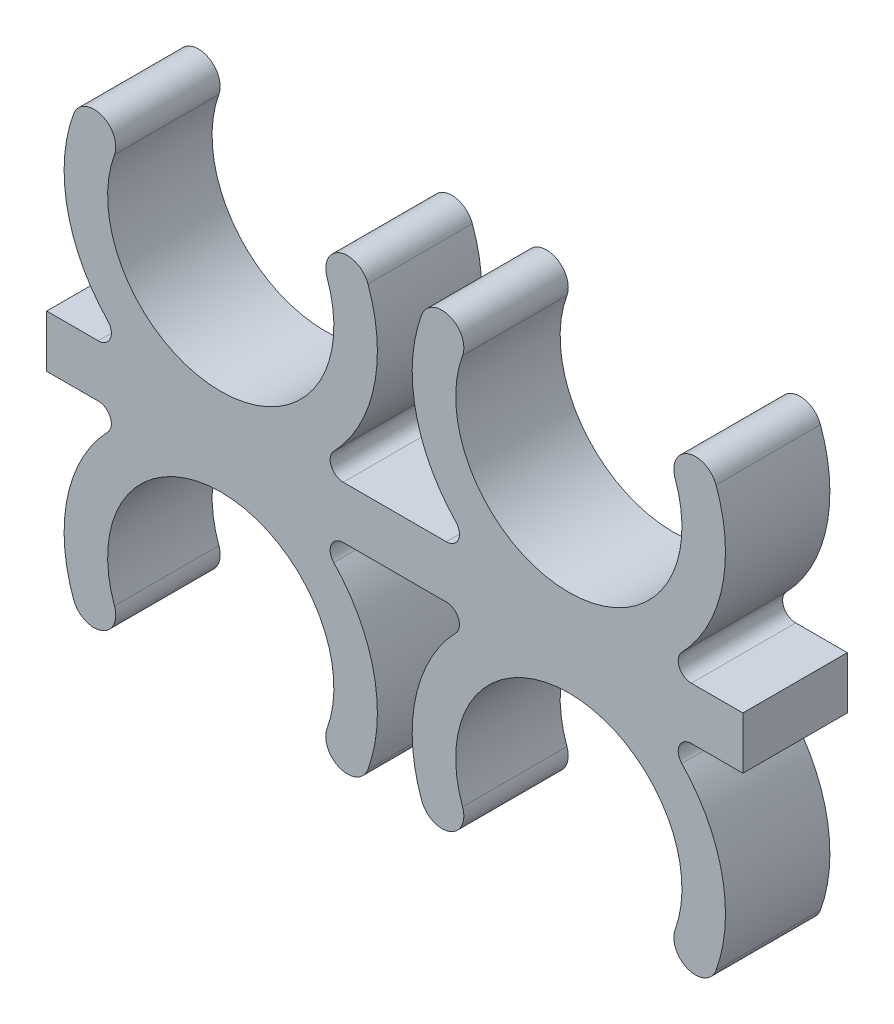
ISO-10303-21;
HEADER;
FILE_DESCRIPTION(('STEP AP214'),'2;1');
FILE_NAME('part.step','',(''),(''),'','','');
FILE_SCHEMA(('AUTOMOTIVE_DESIGN { 1 0 10303 214 1 1 1 1 }'));
ENDSEC;
DATA;
#1=APPLICATION_CONTEXT('core data for automotive mechanical design processes');
#2=APPLICATION_PROTOCOL_DEFINITION('international standard','automotive_design',2000,#1);
#3=PRODUCT_CONTEXT('',#1,'mechanical');
#4=PRODUCT('Part','Part','',(#3));
#5=PRODUCT_RELATED_PRODUCT_CATEGORY('part','',(#4));
#6=PRODUCT_DEFINITION_FORMATION('','',#4);
#7=PRODUCT_DEFINITION_CONTEXT('part definition',#1,'design');
#8=PRODUCT_DEFINITION('design','',#6,#7);
#9=PRODUCT_DEFINITION_SHAPE('','',#8);
#10=(LENGTH_UNIT() NAMED_UNIT(*) SI_UNIT(.MILLI.,.METRE.));
#11=(NAMED_UNIT(*) PLANE_ANGLE_UNIT() SI_UNIT($,.RADIAN.));
#12=(NAMED_UNIT(*) SI_UNIT($,.STERADIAN.) SOLID_ANGLE_UNIT());
#13=UNCERTAINTY_MEASURE_WITH_UNIT(LENGTH_MEASURE(1.E-05),#10,'distance_accuracy_value','');
#14=(GEOMETRIC_REPRESENTATION_CONTEXT(3) GLOBAL_UNCERTAINTY_ASSIGNED_CONTEXT((#13)) GLOBAL_UNIT_ASSIGNED_CONTEXT((#10,
#11,#12)) REPRESENTATION_CONTEXT('',''));
#15=CARTESIAN_POINT('',(0.,0.,0.));
#16=DIRECTION('',(0.,0.,1.));
#17=DIRECTION('',(1.,0.,0.));
#18=AXIS2_PLACEMENT_3D('',#15,#16,#17);
#19=CARTESIAN_POINT('',(0.,0.,6.));
#20=DIRECTION('',(0.,0.,-1.));
#21=DIRECTION('',(-1.,0.,0.));
#22=AXIS2_PLACEMENT_3D('',#19,#20,#21);
#23=CYLINDRICAL_SURFACE('',#22,6.5);
#24=CARTESIAN_POINT('',(0.,0.,0.));
#25=DIRECTION('',(0.,0.,-1.));
#26=DIRECTION('',(1.,0.,0.));
#27=AXIS2_PLACEMENT_3D('',#24,#25,#26);
#28=CIRCLE('',#27,6.5);
#29=CARTESIAN_POINT('',(6.1080020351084,2.22313093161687,0.));
#30=VERTEX_POINT('',#29);
#31=CARTESIAN_POINT('',(-6.1080020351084,2.22313093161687,0.));
#32=VERTEX_POINT('',#31);
#33=EDGE_CURVE('E521',#30,#32,#28,.T.);
#34=ORIENTED_EDGE('',*,*,#33,.T.);
#35=DIRECTION('',(0.,0.,-1.));
#36=VECTOR('',#35,1.);
#37=CARTESIAN_POINT('',(-6.1080020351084,2.22313093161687,6.));
#38=LINE('',#37,#36);
#39=CARTESIAN_POINT('',(-6.1080020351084,2.22313093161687,6.));
#40=VERTEX_POINT('',#39);
#41=EDGE_CURVE('E539',#40,#32,#38,.T.);
#42=ORIENTED_EDGE('',*,*,#41,.F.);
#43=CARTESIAN_POINT('',(0.,0.,6.));
#44=DIRECTION('',(0.,0.,-1.));
#45=DIRECTION('',(1.,0.,0.));
#46=AXIS2_PLACEMENT_3D('',#43,#44,#45);
#47=CIRCLE('',#46,6.5);
#48=CARTESIAN_POINT('',(6.1080020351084,2.22313093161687,6.));
#49=VERTEX_POINT('',#48);
#50=EDGE_CURVE('E522',#49,#40,#47,.T.);
#51=ORIENTED_EDGE('',*,*,#50,.F.);
#52=DIRECTION('',(0.,0.,-1.));
#53=VECTOR('',#52,1.);
#54=CARTESIAN_POINT('',(6.1080020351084,2.22313093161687,6.));
#55=LINE('',#54,#53);
#56=EDGE_CURVE('E512',#49,#30,#55,.T.);
#57=ORIENTED_EDGE('',*,*,#56,.T.);
#58=EDGE_LOOP('',(#34,#42,#51,#57));
#59=FACE_BOUND('',#58,.T.);
#60=ADVANCED_FACE('F33',(#59),#23,.F.);
#61=CARTESIAN_POINT('',(-7.28261781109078,2.65065611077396,6.));
#62=DIRECTION('',(0.,0.,-1.));
#63=DIRECTION('',(-1.,0.,0.));
#64=AXIS2_PLACEMENT_3D('',#61,#62,#63);
#65=CYLINDRICAL_SURFACE('',#64,1.25);
#66=CARTESIAN_POINT('',(-7.28261781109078,2.65065611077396,0.));
#67=DIRECTION('',(0.,0.,1.));
#68=DIRECTION('',(-1.,0.,0.));
#69=AXIS2_PLACEMENT_3D('',#66,#67,#68);
#70=CIRCLE('',#69,1.25);
#71=CARTESIAN_POINT('',(-8.45723358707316,3.07818128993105,0.));
#72=VERTEX_POINT('',#71);
#73=EDGE_CURVE('E533',#32,#72,#70,.T.);
#74=ORIENTED_EDGE('',*,*,#73,.T.);
#75=DIRECTION('',(0.,0.,-1.));
#76=VECTOR('',#75,1.);
#77=CARTESIAN_POINT('',(-8.45723358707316,3.07818128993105,6.));
#78=LINE('',#77,#76);
#79=CARTESIAN_POINT('',(-8.45723358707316,3.07818128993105,6.));
#80=VERTEX_POINT('',#79);
#81=EDGE_CURVE('E530',#80,#72,#78,.T.);
#82=ORIENTED_EDGE('',*,*,#81,.F.);
#83=CARTESIAN_POINT('',(-7.28261781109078,2.65065611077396,6.));
#84=DIRECTION('',(0.,0.,1.));
#85=DIRECTION('',(-1.,0.,0.));
#86=AXIS2_PLACEMENT_3D('',#83,#84,#85);
#87=CIRCLE('',#86,1.25);
#88=EDGE_CURVE('E525',#40,#80,#87,.T.);
#89=ORIENTED_EDGE('',*,*,#88,.F.);
#90=ORIENTED_EDGE('',*,*,#41,.T.);
#91=EDGE_LOOP('',(#74,#82,#89,#90));
#92=FACE_BOUND('',#91,.T.);
#93=ADVANCED_FACE('F578',(#92),#65,.T.);
#94=CARTESIAN_POINT('',(0.,0.,6.));
#95=DIRECTION('',(0.,0.,-1.));
#96=DIRECTION('',(-1.,0.,0.));
#97=AXIS2_PLACEMENT_3D('',#94,#95,#96);
#98=CYLINDRICAL_SURFACE('',#97,9.);
#99=CARTESIAN_POINT('',(0.,0.,0.));
#100=DIRECTION('',(0.,0.,1.));
#101=DIRECTION('',(1.,0.,0.));
#102=AXIS2_PLACEMENT_3D('',#99,#100,#101);
#103=CIRCLE('',#102,9.);
#104=CARTESIAN_POINT('',(-6.49442182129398,-6.23076923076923,0.));
#105=VERTEX_POINT('',#104);
#106=EDGE_CURVE('E526',#72,#105,#103,.T.);
#107=ORIENTED_EDGE('',*,*,#106,.T.);
#108=DIRECTION('',(0.,0.,-1.));
#109=VECTOR('',#108,1.);
#110=CARTESIAN_POINT('',(-6.49442182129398,-6.23076923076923,6.));
#111=LINE('',#110,#109);
#112=CARTESIAN_POINT('',(-6.49442182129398,-6.23076923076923,6.));
#113=VERTEX_POINT('',#112);
#114=EDGE_CURVE('E547',#105,#113,#111,.F.);
#115=ORIENTED_EDGE('',*,*,#114,.T.);
#116=CARTESIAN_POINT('',(0.,0.,6.));
#117=DIRECTION('',(0.,0.,1.));
#118=DIRECTION('',(1.,0.,0.));
#119=AXIS2_PLACEMENT_3D('',#116,#117,#118);
#120=CIRCLE('',#119,9.);
#121=EDGE_CURVE('E528',#80,#113,#120,.T.);
#122=ORIENTED_EDGE('',*,*,#121,.F.);
#123=ORIENTED_EDGE('',*,*,#81,.T.);
#124=EDGE_LOOP('',(#107,#115,#122,#123));
#125=FACE_BOUND('',#124,.T.);
#126=ADVANCED_FACE('F582',(#125),#98,.T.);
#127=CARTESIAN_POINT('',(0.,0.,6.));
#128=DIRECTION('',(0.,0.,1.));
#129=DIRECTION('',(1.,0.,0.));
#130=AXIS2_PLACEMENT_3D('',#127,#128,#129);
#131=PLANE('',#130);
#132=DIRECTION('',(0.,-1.,0.));
#133=VECTOR('',#132,1.);
#134=CARTESIAN_POINT('',(-10.,-13.5,6.));
#135=LINE('',#134,#133);
#136=CARTESIAN_POINT('',(-10.,-7.5,6.));
#137=VERTEX_POINT('',#136);
#138=CARTESIAN_POINT('',(-10.,-10.5,6.));
#139=VERTEX_POINT('',#138);
#140=EDGE_CURVE('E500',#137,#139,#135,.T.);
#141=ORIENTED_EDGE('',*,*,#140,.T.);
#142=DIRECTION('',(-1.,0.,0.));
#143=VECTOR('',#142,1.);
#144=CARTESIAN_POINT('',(-10.,-10.5,6.));
#145=LINE('',#144,#143);
#146=CARTESIAN_POINT('',(-7.03562363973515,-10.5,6.));
#147=VERTEX_POINT('',#146);
#148=EDGE_CURVE('E349',#147,#139,#145,.T.);
#149=ORIENTED_EDGE('',*,*,#148,.F.);
#150=CARTESIAN_POINT('',(-7.03562363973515,-11.25,6.));
#151=DIRECTION('',(0.,0.,-1.));
#152=DIRECTION('',(1.,0.,0.));
#153=AXIS2_PLACEMENT_3D('',#150,#151,#152);
#154=CIRCLE('',#153,0.75);
#155=CARTESIAN_POINT('',(-6.49442182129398,-11.7692307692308,6.));
#156=VERTEX_POINT('',#155);
#157=EDGE_CURVE('E416',#156,#147,#154,.F.);
#158=ORIENTED_EDGE('',*,*,#157,.F.);
#159=CARTESIAN_POINT('',(0.,-18.,6.));
#160=DIRECTION('',(0.,0.,-1.));
#161=DIRECTION('',(1.,0.,0.));
#162=AXIS2_PLACEMENT_3D('',#159,#160,#161);
#163=CIRCLE('',#162,9.);
#164=CARTESIAN_POINT('',(-8.45723358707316,-21.078181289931,6.));
#165=VERTEX_POINT('',#164);
#166=EDGE_CURVE('E385',#165,#156,#163,.T.);
#167=ORIENTED_EDGE('',*,*,#166,.F.);
#168=CARTESIAN_POINT('',(-7.28261781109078,-20.650656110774,6.));
#169=DIRECTION('',(0.,0.,-1.));
#170=DIRECTION('',(-1.,0.,0.));
#171=AXIS2_PLACEMENT_3D('',#168,#169,#170);
#172=CIRCLE('',#171,1.25);
#173=CARTESIAN_POINT('',(-6.1080020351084,-20.2231309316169,6.));
#174=VERTEX_POINT('',#173);
#175=EDGE_CURVE('E381',#174,#165,#172,.T.);
#176=ORIENTED_EDGE('',*,*,#175,.F.);
#177=CARTESIAN_POINT('',(0.,-18.,6.));
#178=DIRECTION('',(0.,0.,1.));
#179=DIRECTION('',(1.,0.,0.));
#180=AXIS2_PLACEMENT_3D('',#177,#178,#179);
#181=CIRCLE('',#180,6.5);
#182=CARTESIAN_POINT('',(6.1080020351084,-20.2231309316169,6.));
#183=VERTEX_POINT('',#182);
#184=EDGE_CURVE('E378',#183,#174,#181,.T.);
#185=ORIENTED_EDGE('',*,*,#184,.F.);
#186=CARTESIAN_POINT('',(7.28261781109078,-20.650656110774,6.));
#187=DIRECTION('',(0.,0.,1.));
#188=DIRECTION('',(1.,0.,0.));
#189=AXIS2_PLACEMENT_3D('',#186,#187,#188);
#190=CIRCLE('',#189,1.25);
#191=CARTESIAN_POINT('',(8.45723358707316,-21.078181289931,6.));
#192=VERTEX_POINT('',#191);
#193=EDGE_CURVE('E364',#183,#192,#190,.T.);
#194=ORIENTED_EDGE('',*,*,#193,.T.);
#195=CARTESIAN_POINT('',(0.,-18.,6.));
#196=DIRECTION('',(0.,0.,1.));
#197=DIRECTION('',(-1.,0.,0.));
#198=AXIS2_PLACEMENT_3D('',#195,#196,#197);
#199=CIRCLE('',#198,9.);
#200=CARTESIAN_POINT('',(6.49442182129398,-11.7692307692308,6.));
#201=VERTEX_POINT('',#200);
#202=EDGE_CURVE('E361',#192,#201,#199,.T.);
#203=ORIENTED_EDGE('',*,*,#202,.T.);
#204=CARTESIAN_POINT('',(7.03562363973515,-11.25,6.));
#205=DIRECTION('',(0.,0.,-1.));
#206=DIRECTION('',(1.,0.,0.));
#207=AXIS2_PLACEMENT_3D('',#204,#205,#206);
#208=CIRCLE('',#207,0.75);
#209=CARTESIAN_POINT('',(7.03562363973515,-10.5,6.));
#210=VERTEX_POINT('',#209);
#211=EDGE_CURVE('E410',#210,#201,#208,.F.);
#212=ORIENTED_EDGE('',*,*,#211,.F.);
#213=CARTESIAN_POINT('',(12.9643763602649,-10.5,6.));
#214=VERTEX_POINT('',#213);
#215=EDGE_CURVE('E355',#214,#210,#145,.T.);
#216=ORIENTED_EDGE('',*,*,#215,.F.);
#217=CARTESIAN_POINT('',(12.9643763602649,-11.25,6.));
#218=DIRECTION('',(0.,0.,1.));
#219=DIRECTION('',(-1.,0.,0.));
#220=AXIS2_PLACEMENT_3D('',#217,#218,#219);
#221=CIRCLE('',#220,0.75);
#222=CARTESIAN_POINT('',(13.505578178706,-11.7692307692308,6.));
#223=VERTEX_POINT('',#222);
#224=EDGE_CURVE('E338',#214,#223,#221,.F.);
#225=ORIENTED_EDGE('',*,*,#224,.T.);
#226=CARTESIAN_POINT('',(20.,-18.,6.));
#227=DIRECTION('',(0.,0.,-1.));
#228=DIRECTION('',(1.,0.,0.));
#229=AXIS2_PLACEMENT_3D('',#226,#227,#228);
#230=CIRCLE('',#229,9.);
#231=CARTESIAN_POINT('',(11.5427664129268,-21.078181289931,6.));
#232=VERTEX_POINT('',#231);
#233=EDGE_CURVE('E294',#232,#223,#230,.T.);
#234=ORIENTED_EDGE('',*,*,#233,.F.);
#235=CARTESIAN_POINT('',(12.7173821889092,-20.650656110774,6.));
#236=DIRECTION('',(0.,0.,-1.));
#237=DIRECTION('',(-1.,0.,0.));
#238=AXIS2_PLACEMENT_3D('',#235,#236,#237);
#239=CIRCLE('',#238,1.25);
#240=CARTESIAN_POINT('',(13.8919979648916,-20.2231309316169,6.));
#241=VERTEX_POINT('',#240);
#242=EDGE_CURVE('E297',#241,#232,#239,.T.);
#243=ORIENTED_EDGE('',*,*,#242,.F.);
#244=CARTESIAN_POINT('',(20.,-18.,6.));
#245=DIRECTION('',(0.,0.,-1.));
#246=DIRECTION('',(-1.,0.,0.));
#247=AXIS2_PLACEMENT_3D('',#244,#245,#246);
#248=CIRCLE('',#247,6.5);
#249=CARTESIAN_POINT('',(26.1080020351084,-20.2231309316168,6.));
#250=VERTEX_POINT('',#249);
#251=EDGE_CURVE('E310',#241,#250,#248,.T.);
#252=ORIENTED_EDGE('',*,*,#251,.T.);
#253=CARTESIAN_POINT('',(27.2826178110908,-20.6506561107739,6.));
#254=DIRECTION('',(0.,0.,1.));
#255=DIRECTION('',(1.,0.,0.));
#256=AXIS2_PLACEMENT_3D('',#253,#254,#255);
#257=CIRCLE('',#256,1.25);
#258=CARTESIAN_POINT('',(28.4572335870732,-21.078181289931,6.));
#259=VERTEX_POINT('',#258);
#260=EDGE_CURVE('E313',#250,#259,#257,.T.);
#261=ORIENTED_EDGE('',*,*,#260,.T.);
#262=CARTESIAN_POINT('',(20.,-18.,6.));
#263=DIRECTION('',(0.,0.,1.));
#264=DIRECTION('',(-1.,0.,0.));
#265=AXIS2_PLACEMENT_3D('',#262,#263,#264);
#266=CIRCLE('',#265,9.);
#267=CARTESIAN_POINT('',(26.494421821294,-11.7692307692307,6.));
#268=VERTEX_POINT('',#267);
#269=EDGE_CURVE('E317',#259,#268,#266,.T.);
#270=ORIENTED_EDGE('',*,*,#269,.T.);
#271=CARTESIAN_POINT('',(27.0356236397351,-11.25,6.));
#272=DIRECTION('',(0.,0.,1.));
#273=DIRECTION('',(-1.,0.,0.));
#274=AXIS2_PLACEMENT_3D('',#271,#272,#273);
#275=CIRCLE('',#274,0.75);
#276=CARTESIAN_POINT('',(27.0356236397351,-10.5,6.));
#277=VERTEX_POINT('',#276);
#278=EDGE_CURVE('E344',#268,#277,#275,.F.);
#279=ORIENTED_EDGE('',*,*,#278,.T.);
#280=DIRECTION('',(1.,0.,0.));
#281=VECTOR('',#280,1.);
#282=CARTESIAN_POINT('',(30.,-10.5,6.));
#283=LINE('',#282,#281);
#284=CARTESIAN_POINT('',(30.,-10.5,6.));
#285=VERTEX_POINT('',#284);
#286=EDGE_CURVE('E290',#277,#285,#283,.T.);
#287=ORIENTED_EDGE('',*,*,#286,.T.);
#288=DIRECTION('',(0.,-1.,0.));
#289=VECTOR('',#288,1.);
#290=CARTESIAN_POINT('',(30.,-13.5,6.));
#291=LINE('',#290,#289);
#292=CARTESIAN_POINT('',(30.,-7.50000000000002,6.));
#293=VERTEX_POINT('',#292);
#294=EDGE_CURVE('E276',#293,#285,#291,.T.);
#295=ORIENTED_EDGE('',*,*,#294,.F.);
#296=DIRECTION('',(1.,0.,0.));
#297=VECTOR('',#296,1.);
#298=CARTESIAN_POINT('',(30.,-7.50000000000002,6.));
#299=LINE('',#298,#297);
#300=CARTESIAN_POINT('',(27.0356236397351,-7.50000000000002,6.));
#301=VERTEX_POINT('',#300);
#302=EDGE_CURVE('E421',#301,#293,#299,.T.);
#303=ORIENTED_EDGE('',*,*,#302,.F.);
#304=CARTESIAN_POINT('',(27.0356236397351,-6.75000000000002,6.));
#305=DIRECTION('',(0.,0.,-1.));
#306=DIRECTION('',(-1.,0.,0.));
#307=AXIS2_PLACEMENT_3D('',#304,#305,#306);
#308=CIRCLE('',#307,0.75);
#309=CARTESIAN_POINT('',(26.494421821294,-6.23076923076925,6.));
#310=VERTEX_POINT('',#309);
#311=EDGE_CURVE('E484',#310,#301,#308,.F.);
#312=ORIENTED_EDGE('',*,*,#311,.F.);
#313=CARTESIAN_POINT('',(20.,0.,6.));
#314=DIRECTION('',(0.,0.,-1.));
#315=DIRECTION('',(-1.,0.,0.));
#316=AXIS2_PLACEMENT_3D('',#313,#314,#315);
#317=CIRCLE('',#316,9.);
#318=CARTESIAN_POINT('',(28.4572335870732,3.07818128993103,6.));
#319=VERTEX_POINT('',#318);
#320=EDGE_CURVE('E452',#319,#310,#317,.T.);
#321=ORIENTED_EDGE('',*,*,#320,.F.);
#322=CARTESIAN_POINT('',(27.2826178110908,2.65065611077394,6.));
#323=DIRECTION('',(0.,0.,-1.));
#324=DIRECTION('',(1.,0.,0.));
#325=AXIS2_PLACEMENT_3D('',#322,#323,#324);
#326=CIRCLE('',#325,1.25);
#327=CARTESIAN_POINT('',(26.1080020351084,2.22313093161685,6.));
#328=VERTEX_POINT('',#327);
#329=EDGE_CURVE('E448',#328,#319,#326,.T.);
#330=ORIENTED_EDGE('',*,*,#329,.F.);
#331=CARTESIAN_POINT('',(20.,0.,6.));
#332=DIRECTION('',(0.,0.,1.));
#333=DIRECTION('',(-1.,0.,0.));
#334=AXIS2_PLACEMENT_3D('',#331,#332,#333);
#335=CIRCLE('',#334,6.5);
#336=CARTESIAN_POINT('',(13.8919979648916,2.22313093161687,6.));
#337=VERTEX_POINT('',#336);
#338=EDGE_CURVE('E445',#337,#328,#335,.T.);
#339=ORIENTED_EDGE('',*,*,#338,.F.);
#340=CARTESIAN_POINT('',(12.7173821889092,2.65065611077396,6.));
#341=DIRECTION('',(0.,0.,1.));
#342=DIRECTION('',(-1.,0.,0.));
#343=AXIS2_PLACEMENT_3D('',#340,#341,#342);
#344=CIRCLE('',#343,1.25);
#345=CARTESIAN_POINT('',(11.5427664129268,3.07818128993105,6.));
#346=VERTEX_POINT('',#345);
#347=EDGE_CURVE('E431',#337,#346,#344,.T.);
#348=ORIENTED_EDGE('',*,*,#347,.T.);
#349=CARTESIAN_POINT('',(20.,0.,6.));
#350=DIRECTION('',(0.,0.,1.));
#351=DIRECTION('',(1.,0.,0.));
#352=AXIS2_PLACEMENT_3D('',#349,#350,#351);
#353=CIRCLE('',#352,9.);
#354=CARTESIAN_POINT('',(13.505578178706,-6.23076923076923,6.));
#355=VERTEX_POINT('',#354);
#356=EDGE_CURVE('E428',#346,#355,#353,.T.);
#357=ORIENTED_EDGE('',*,*,#356,.T.);
#358=CARTESIAN_POINT('',(12.9643763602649,-6.75,6.));
#359=DIRECTION('',(0.,0.,-1.));
#360=DIRECTION('',(-1.,0.,0.));
#361=AXIS2_PLACEMENT_3D('',#358,#359,#360);
#362=CIRCLE('',#361,0.75);
#363=CARTESIAN_POINT('',(12.9643763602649,-7.5,6.));
#364=VERTEX_POINT('',#363);
#365=EDGE_CURVE('E478',#364,#355,#362,.F.);
#366=ORIENTED_EDGE('',*,*,#365,.F.);
#367=DIRECTION('',(-1.,0.,0.));
#368=VECTOR('',#367,1.);
#369=CARTESIAN_POINT('',(-10.,-7.5,6.));
#370=LINE('',#369,#368);
#371=CARTESIAN_POINT('',(7.03562363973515,-7.5,6.));
#372=VERTEX_POINT('',#371);
#373=EDGE_CURVE('E495',#364,#372,#370,.T.);
#374=ORIENTED_EDGE('',*,*,#373,.T.);
#375=CARTESIAN_POINT('',(7.03562363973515,-6.75,6.));
#376=DIRECTION('',(0.,0.,1.));
#377=DIRECTION('',(1.,0.,0.));
#378=AXIS2_PLACEMENT_3D('',#375,#376,#377);
#379=CIRCLE('',#378,0.75);
#380=CARTESIAN_POINT('',(6.49442182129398,-6.23076923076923,6.));
#381=VERTEX_POINT('',#380);
#382=EDGE_CURVE('E551',#372,#381,#379,.F.);
#383=ORIENTED_EDGE('',*,*,#382,.T.);
#384=CARTESIAN_POINT('',(0.,0.,6.));
#385=DIRECTION('',(0.,0.,-1.));
#386=DIRECTION('',(-1.,0.,0.));
#387=AXIS2_PLACEMENT_3D('',#384,#385,#386);
#388=CIRCLE('',#387,9.);
#389=CARTESIAN_POINT('',(8.45723358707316,3.07818128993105,6.));
#390=VERTEX_POINT('',#389);
#391=EDGE_CURVE('E505',#390,#381,#388,.T.);
#392=ORIENTED_EDGE('',*,*,#391,.F.);
#393=CARTESIAN_POINT('',(7.28261781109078,2.65065611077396,6.));
#394=DIRECTION('',(0.,0.,-1.));
#395=DIRECTION('',(1.,0.,0.));
#396=AXIS2_PLACEMENT_3D('',#393,#394,#395);
#397=CIRCLE('',#396,1.25);
#398=EDGE_CURVE('E508',#49,#390,#397,.T.);
#399=ORIENTED_EDGE('',*,*,#398,.F.);
#400=ORIENTED_EDGE('',*,*,#50,.T.);
#401=ORIENTED_EDGE('',*,*,#88,.T.);
#402=ORIENTED_EDGE('',*,*,#121,.T.);
#403=CARTESIAN_POINT('',(-7.03562363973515,-6.75,6.));
#404=DIRECTION('',(0.,0.,1.));
#405=DIRECTION('',(1.,0.,0.));
#406=AXIS2_PLACEMENT_3D('',#403,#404,#405);
#407=CIRCLE('',#406,0.75);
#408=CARTESIAN_POINT('',(-7.03562363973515,-7.5,6.));
#409=VERTEX_POINT('',#408);
#410=EDGE_CURVE('E41',#113,#409,#407,.F.);
#411=ORIENTED_EDGE('',*,*,#410,.T.);
#412=EDGE_CURVE('E489',#409,#137,#370,.T.);
#413=ORIENTED_EDGE('',*,*,#412,.T.);
#414=EDGE_LOOP('',(#141,#149,#158,#167,#176,#185,#194,#203,#212,#216,#225,#234,#243,#252,#261,
#270,#279,#287,#295,#303,#312,#321,#330,#339,#348,#357,#366,#374,#383,#392,#399,#400,#401,#402,
#411,#413));
#415=FACE_BOUND('',#414,.T.);
#416=ADVANCED_FACE('F565',(#415),#131,.T.);
#417=CARTESIAN_POINT('',(0.,0.,0.));
#418=DIRECTION('',(0.,0.,1.));
#419=DIRECTION('',(1.,0.,0.));
#420=AXIS2_PLACEMENT_3D('',#417,#418,#419);
#421=PLANE('',#420);
#422=DIRECTION('',(-1.,0.,0.));
#423=VECTOR('',#422,1.);
#424=CARTESIAN_POINT('',(-10.,-7.5,0.));
#425=LINE('',#424,#423);
#426=CARTESIAN_POINT('',(12.9643763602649,-7.5,0.));
#427=VERTEX_POINT('',#426);
#428=CARTESIAN_POINT('',(7.03562363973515,-7.5,0.));
#429=VERTEX_POINT('',#428);
#430=EDGE_CURVE('E490',#427,#429,#425,.T.);
#431=ORIENTED_EDGE('',*,*,#430,.F.);
#432=CARTESIAN_POINT('',(12.9643763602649,-6.75,0.));
#433=DIRECTION('',(0.,0.,-1.));
#434=DIRECTION('',(-1.,0.,0.));
#435=AXIS2_PLACEMENT_3D('',#432,#433,#434);
#436=CIRCLE('',#435,0.75);
#437=CARTESIAN_POINT('',(13.505578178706,-6.23076923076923,0.));
#438=VERTEX_POINT('',#437);
#439=EDGE_CURVE('E481',#438,#427,#436,.T.);
#440=ORIENTED_EDGE('',*,*,#439,.F.);
#441=CARTESIAN_POINT('',(20.,0.,0.));
#442=DIRECTION('',(0.,0.,1.));
#443=DIRECTION('',(1.,0.,0.));
#444=AXIS2_PLACEMENT_3D('',#441,#442,#443);
#445=CIRCLE('',#444,9.);
#446=CARTESIAN_POINT('',(11.5427664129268,3.07818128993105,0.));
#447=VERTEX_POINT('',#446);
#448=EDGE_CURVE('E275',#447,#438,#445,.T.);
#449=ORIENTED_EDGE('',*,*,#448,.F.);
#450=CARTESIAN_POINT('',(12.7173821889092,2.65065611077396,0.));
#451=DIRECTION('',(0.,0.,1.));
#452=DIRECTION('',(-1.,0.,0.));
#453=AXIS2_PLACEMENT_3D('',#450,#451,#452);
#454=CIRCLE('',#453,1.25);
#455=CARTESIAN_POINT('',(13.8919979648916,2.22313093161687,0.));
#456=VERTEX_POINT('',#455);
#457=EDGE_CURVE('E432',#456,#447,#454,.T.);
#458=ORIENTED_EDGE('',*,*,#457,.F.);
#459=CARTESIAN_POINT('',(20.,0.,0.));
#460=DIRECTION('',(0.,0.,1.));
#461=DIRECTION('',(-1.,0.,0.));
#462=AXIS2_PLACEMENT_3D('',#459,#460,#461);
#463=CIRCLE('',#462,6.5);
#464=CARTESIAN_POINT('',(26.1080020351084,2.22313093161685,0.));
#465=VERTEX_POINT('',#464);
#466=EDGE_CURVE('E444',#456,#465,#463,.T.);
#467=ORIENTED_EDGE('',*,*,#466,.T.);
#468=CARTESIAN_POINT('',(27.2826178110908,2.65065611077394,0.));
#469=DIRECTION('',(0.,0.,-1.));
#470=DIRECTION('',(1.,0.,0.));
#471=AXIS2_PLACEMENT_3D('',#468,#469,#470);
#472=CIRCLE('',#471,1.25);
#473=CARTESIAN_POINT('',(28.4572335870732,3.07818128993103,0.));
#474=VERTEX_POINT('',#473);
#475=EDGE_CURVE('E458',#465,#474,#472,.T.);
#476=ORIENTED_EDGE('',*,*,#475,.T.);
#477=CARTESIAN_POINT('',(20.,0.,0.));
#478=DIRECTION('',(0.,0.,-1.));
#479=DIRECTION('',(-1.,0.,0.));
#480=AXIS2_PLACEMENT_3D('',#477,#478,#479);
#481=CIRCLE('',#480,9.);
#482=CARTESIAN_POINT('',(26.494421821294,-6.23076923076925,0.));
#483=VERTEX_POINT('',#482);
#484=EDGE_CURVE('E449',#474,#483,#481,.T.);
#485=ORIENTED_EDGE('',*,*,#484,.T.);
#486=CARTESIAN_POINT('',(27.0356236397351,-6.75000000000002,0.));
#487=DIRECTION('',(0.,0.,-1.));
#488=DIRECTION('',(-1.,0.,0.));
#489=AXIS2_PLACEMENT_3D('',#486,#487,#488);
#490=CIRCLE('',#489,0.75);
#491=CARTESIAN_POINT('',(27.0356236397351,-7.50000000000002,0.));
#492=VERTEX_POINT('',#491);
#493=EDGE_CURVE('E487',#492,#483,#490,.T.);
#494=ORIENTED_EDGE('',*,*,#493,.F.);
#495=DIRECTION('',(1.,0.,0.));
#496=VECTOR('',#495,1.);
#497=CARTESIAN_POINT('',(30.,-7.50000000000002,0.));
#498=LINE('',#497,#496);
#499=CARTESIAN_POINT('',(30.,-7.50000000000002,0.));
#500=VERTEX_POINT('',#499);
#501=EDGE_CURVE('E273',#492,#500,#498,.T.);
#502=ORIENTED_EDGE('',*,*,#501,.T.);
#503=DIRECTION('',(0.,-1.,0.));
#504=VECTOR('',#503,1.);
#505=CARTESIAN_POINT('',(30.,-13.5,0.));
#506=LINE('',#505,#504);
#507=CARTESIAN_POINT('',(30.,-10.5,0.));
#508=VERTEX_POINT('',#507);
#509=EDGE_CURVE('E265',#500,#508,#506,.T.);
#510=ORIENTED_EDGE('',*,*,#509,.T.);
#511=DIRECTION('',(1.,0.,0.));
#512=VECTOR('',#511,1.);
#513=CARTESIAN_POINT('',(30.,-10.5,0.));
#514=LINE('',#513,#512);
#515=CARTESIAN_POINT('',(27.0356236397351,-10.5,0.));
#516=VERTEX_POINT('',#515);
#517=EDGE_CURVE('E270',#516,#508,#514,.T.);
#518=ORIENTED_EDGE('',*,*,#517,.F.);
#519=CARTESIAN_POINT('',(27.0356236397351,-11.25,0.));
#520=DIRECTION('',(0.,0.,1.));
#521=DIRECTION('',(-1.,0.,0.));
#522=AXIS2_PLACEMENT_3D('',#519,#520,#521);
#523=CIRCLE('',#522,0.75);
#524=CARTESIAN_POINT('',(26.494421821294,-11.7692307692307,0.));
#525=VERTEX_POINT('',#524);
#526=EDGE_CURVE('E347',#516,#525,#523,.T.);
#527=ORIENTED_EDGE('',*,*,#526,.T.);
#528=CARTESIAN_POINT('',(20.,-18.,0.));
#529=DIRECTION('',(0.,0.,1.));
#530=DIRECTION('',(-1.,0.,0.));
#531=AXIS2_PLACEMENT_3D('',#528,#529,#530);
#532=CIRCLE('',#531,9.);
#533=CARTESIAN_POINT('',(28.4572335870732,-21.078181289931,0.));
#534=VERTEX_POINT('',#533);
#535=EDGE_CURVE('E314',#534,#525,#532,.T.);
#536=ORIENTED_EDGE('',*,*,#535,.F.);
#537=CARTESIAN_POINT('',(27.2826178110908,-20.6506561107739,0.));
#538=DIRECTION('',(0.,0.,1.));
#539=DIRECTION('',(1.,0.,0.));
#540=AXIS2_PLACEMENT_3D('',#537,#538,#539);
#541=CIRCLE('',#540,1.25);
#542=CARTESIAN_POINT('',(26.1080020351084,-20.2231309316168,0.));
#543=VERTEX_POINT('',#542);
#544=EDGE_CURVE('E323',#543,#534,#541,.T.);
#545=ORIENTED_EDGE('',*,*,#544,.F.);
#546=CARTESIAN_POINT('',(20.,-18.,0.));
#547=DIRECTION('',(0.,0.,-1.));
#548=DIRECTION('',(-1.,0.,0.));
#549=AXIS2_PLACEMENT_3D('',#546,#547,#548);
#550=CIRCLE('',#549,6.5);
#551=CARTESIAN_POINT('',(13.8919979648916,-20.2231309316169,0.));
#552=VERTEX_POINT('',#551);
#553=EDGE_CURVE('E309',#552,#543,#550,.T.);
#554=ORIENTED_EDGE('',*,*,#553,.F.);
#555=CARTESIAN_POINT('',(12.7173821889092,-20.650656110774,0.));
#556=DIRECTION('',(0.,0.,-1.));
#557=DIRECTION('',(-1.,0.,0.));
#558=AXIS2_PLACEMENT_3D('',#555,#556,#557);
#559=CIRCLE('',#558,1.25);
#560=CARTESIAN_POINT('',(11.5427664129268,-21.078181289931,0.));
#561=VERTEX_POINT('',#560);
#562=EDGE_CURVE('E298',#552,#561,#559,.T.);
#563=ORIENTED_EDGE('',*,*,#562,.T.);
#564=CARTESIAN_POINT('',(20.,-18.,0.));
#565=DIRECTION('',(0.,0.,-1.));
#566=DIRECTION('',(1.,0.,0.));
#567=AXIS2_PLACEMENT_3D('',#564,#565,#566);
#568=CIRCLE('',#567,9.);
#569=CARTESIAN_POINT('',(13.505578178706,-11.7692307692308,0.));
#570=VERTEX_POINT('',#569);
#571=EDGE_CURVE('E285',#561,#570,#568,.T.);
#572=ORIENTED_EDGE('',*,*,#571,.T.);
#573=CARTESIAN_POINT('',(12.9643763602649,-11.25,0.));
#574=DIRECTION('',(0.,0.,1.));
#575=DIRECTION('',(-1.,0.,0.));
#576=AXIS2_PLACEMENT_3D('',#573,#574,#575);
#577=CIRCLE('',#576,0.75);
#578=CARTESIAN_POINT('',(12.9643763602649,-10.5,0.));
#579=VERTEX_POINT('',#578);
#580=EDGE_CURVE('E341',#570,#579,#577,.T.);
#581=ORIENTED_EDGE('',*,*,#580,.T.);
#582=DIRECTION('',(-1.,0.,0.));
#583=VECTOR('',#582,1.);
#584=CARTESIAN_POINT('',(-10.,-10.5,0.));
#585=LINE('',#584,#583);
#586=CARTESIAN_POINT('',(7.03562363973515,-10.5,0.));
#587=VERTEX_POINT('',#586);
#588=EDGE_CURVE('E350',#579,#587,#585,.T.);
#589=ORIENTED_EDGE('',*,*,#588,.T.);
#590=CARTESIAN_POINT('',(7.03562363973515,-11.25,0.));
#591=DIRECTION('',(0.,0.,-1.));
#592=DIRECTION('',(1.,0.,0.));
#593=AXIS2_PLACEMENT_3D('',#590,#591,#592);
#594=CIRCLE('',#593,0.75);
#595=CARTESIAN_POINT('',(6.49442182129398,-11.7692307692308,0.));
#596=VERTEX_POINT('',#595);
#597=EDGE_CURVE('E413',#596,#587,#594,.T.);
#598=ORIENTED_EDGE('',*,*,#597,.F.);
#599=CARTESIAN_POINT('',(0.,-18.,0.));
#600=DIRECTION('',(0.,0.,1.));
#601=DIRECTION('',(-1.,0.,0.));
#602=AXIS2_PLACEMENT_3D('',#599,#600,#601);
#603=CIRCLE('',#602,9.);
#604=CARTESIAN_POINT('',(8.45723358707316,-21.078181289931,0.));
#605=VERTEX_POINT('',#604);
#606=EDGE_CURVE('E360',#605,#596,#603,.T.);
#607=ORIENTED_EDGE('',*,*,#606,.F.);
#608=CARTESIAN_POINT('',(7.28261781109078,-20.650656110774,0.));
#609=DIRECTION('',(0.,0.,1.));
#610=DIRECTION('',(1.,0.,0.));
#611=AXIS2_PLACEMENT_3D('',#608,#609,#610);
#612=CIRCLE('',#611,1.25);
#613=CARTESIAN_POINT('',(6.1080020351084,-20.2231309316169,0.));
#614=VERTEX_POINT('',#613);
#615=EDGE_CURVE('E365',#614,#605,#612,.T.);
#616=ORIENTED_EDGE('',*,*,#615,.F.);
#617=CARTESIAN_POINT('',(0.,-18.,0.));
#618=DIRECTION('',(0.,0.,1.));
#619=DIRECTION('',(1.,0.,0.));
#620=AXIS2_PLACEMENT_3D('',#617,#618,#619);
#621=CIRCLE('',#620,6.5);
#622=CARTESIAN_POINT('',(-6.1080020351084,-20.2231309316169,0.));
#623=VERTEX_POINT('',#622);
#624=EDGE_CURVE('E377',#614,#623,#621,.T.);
#625=ORIENTED_EDGE('',*,*,#624,.T.);
#626=CARTESIAN_POINT('',(-7.28261781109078,-20.650656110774,0.));
#627=DIRECTION('',(0.,0.,-1.));
#628=DIRECTION('',(-1.,0.,0.));
#629=AXIS2_PLACEMENT_3D('',#626,#627,#628);
#630=CIRCLE('',#629,1.25);
#631=CARTESIAN_POINT('',(-8.45723358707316,-21.078181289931,0.));
#632=VERTEX_POINT('',#631);
#633=EDGE_CURVE('E391',#623,#632,#630,.T.);
#634=ORIENTED_EDGE('',*,*,#633,.T.);
#635=CARTESIAN_POINT('',(0.,-18.,0.));
#636=DIRECTION('',(0.,0.,-1.));
#637=DIRECTION('',(1.,0.,0.));
#638=AXIS2_PLACEMENT_3D('',#635,#636,#637);
#639=CIRCLE('',#638,9.);
#640=CARTESIAN_POINT('',(-6.49442182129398,-11.7692307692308,0.));
#641=VERTEX_POINT('',#640);
#642=EDGE_CURVE('E382',#632,#641,#639,.T.);
#643=ORIENTED_EDGE('',*,*,#642,.T.);
#644=CARTESIAN_POINT('',(-7.03562363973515,-11.25,0.));
#645=DIRECTION('',(0.,0.,-1.));
#646=DIRECTION('',(1.,0.,0.));
#647=AXIS2_PLACEMENT_3D('',#644,#645,#646);
#648=CIRCLE('',#647,0.75);
#649=CARTESIAN_POINT('',(-7.03562363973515,-10.5,0.));
#650=VERTEX_POINT('',#649);
#651=EDGE_CURVE('E419',#650,#641,#648,.T.);
#652=ORIENTED_EDGE('',*,*,#651,.F.);
#653=CARTESIAN_POINT('',(-10.,-10.5,0.));
#654=VERTEX_POINT('',#653);
#655=EDGE_CURVE('E354',#650,#654,#585,.T.);
#656=ORIENTED_EDGE('',*,*,#655,.T.);
#657=DIRECTION('',(0.,-1.,0.));
#658=VECTOR('',#657,1.);
#659=CARTESIAN_POINT('',(-10.,-13.5,0.));
#660=LINE('',#659,#658);
#661=CARTESIAN_POINT('',(-10.,-7.5,0.));
#662=VERTEX_POINT('',#661);
#663=EDGE_CURVE('E501',#662,#654,#660,.T.);
#664=ORIENTED_EDGE('',*,*,#663,.F.);
#665=CARTESIAN_POINT('',(-7.03562363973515,-7.5,0.));
#666=VERTEX_POINT('',#665);
#667=EDGE_CURVE('E494',#666,#662,#425,.T.);
#668=ORIENTED_EDGE('',*,*,#667,.F.);
#669=CARTESIAN_POINT('',(-7.03562363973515,-6.75,0.));
#670=DIRECTION('',(0.,0.,1.));
#671=DIRECTION('',(1.,0.,0.));
#672=AXIS2_PLACEMENT_3D('',#669,#670,#671);
#673=CIRCLE('',#672,0.75);
#674=EDGE_CURVE('E11',#666,#105,#673,.T.);
#675=ORIENTED_EDGE('',*,*,#674,.T.);
#676=ORIENTED_EDGE('',*,*,#106,.F.);
#677=ORIENTED_EDGE('',*,*,#73,.F.);
#678=ORIENTED_EDGE('',*,*,#33,.F.);
#679=CARTESIAN_POINT('',(7.28261781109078,2.65065611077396,0.));
#680=DIRECTION('',(0.,0.,-1.));
#681=DIRECTION('',(1.,0.,0.));
#682=AXIS2_PLACEMENT_3D('',#679,#680,#681);
#683=CIRCLE('',#682,1.25);
#684=CARTESIAN_POINT('',(8.45723358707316,3.07818128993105,0.));
#685=VERTEX_POINT('',#684);
#686=EDGE_CURVE('E509',#30,#685,#683,.T.);
#687=ORIENTED_EDGE('',*,*,#686,.T.);
#688=CARTESIAN_POINT('',(0.,0.,0.));
#689=DIRECTION('',(0.,0.,-1.));
#690=DIRECTION('',(-1.,0.,0.));
#691=AXIS2_PLACEMENT_3D('',#688,#689,#690);
#692=CIRCLE('',#691,9.);
#693=CARTESIAN_POINT('',(6.49442182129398,-6.23076923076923,0.));
#694=VERTEX_POINT('',#693);
#695=EDGE_CURVE('E503',#685,#694,#692,.T.);
#696=ORIENTED_EDGE('',*,*,#695,.T.);
#697=CARTESIAN_POINT('',(7.03562363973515,-6.75,0.));
#698=DIRECTION('',(0.,0.,1.));
#699=DIRECTION('',(1.,0.,0.));
#700=AXIS2_PLACEMENT_3D('',#697,#698,#699);
#701=CIRCLE('',#700,0.75);
#702=EDGE_CURVE('E553',#694,#429,#701,.T.);
#703=ORIENTED_EDGE('',*,*,#702,.T.);
#704=EDGE_LOOP('',(#431,#440,#449,#458,#467,#476,#485,#494,#502,#510,#518,#527,#536,#545,#554,
#563,#572,#581,#589,#598,#607,#616,#625,#634,#643,#652,#656,#664,#668,#675,#676,#677,#678,#687,
#696,#703));
#705=FACE_BOUND('',#704,.T.);
#706=ADVANCED_FACE('F267',(#705),#421,.F.);
#707=CARTESIAN_POINT('',(0.,0.,6.));
#708=DIRECTION('',(0.,0.,-1.));
#709=DIRECTION('',(-1.,0.,0.));
#710=AXIS2_PLACEMENT_3D('',#707,#708,#709);
#711=CYLINDRICAL_SURFACE('',#710,9.);
#712=ORIENTED_EDGE('',*,*,#391,.T.);
#713=DIRECTION('',(0.,0.,-1.));
#714=VECTOR('',#713,1.);
#715=CARTESIAN_POINT('',(6.49442182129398,-6.23076923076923,6.));
#716=LINE('',#715,#714);
#717=EDGE_CURVE('E545',#381,#694,#716,.T.);
#718=ORIENTED_EDGE('',*,*,#717,.T.);
#719=ORIENTED_EDGE('',*,*,#695,.F.);
#720=DIRECTION('',(0.,0.,-1.));
#721=VECTOR('',#720,1.);
#722=CARTESIAN_POINT('',(8.45723358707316,3.07818128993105,6.));
#723=LINE('',#722,#721);
#724=EDGE_CURVE('E519',#390,#685,#723,.T.);
#725=ORIENTED_EDGE('',*,*,#724,.F.);
#726=EDGE_LOOP('',(#712,#718,#719,#725));
#727=FACE_BOUND('',#726,.T.);
#728=ADVANCED_FACE('F569',(#727),#711,.T.);
#729=CARTESIAN_POINT('',(7.28261781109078,2.65065611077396,6.));
#730=DIRECTION('',(0.,0.,-1.));
#731=DIRECTION('',(-1.,0.,0.));
#732=AXIS2_PLACEMENT_3D('',#729,#730,#731);
#733=CYLINDRICAL_SURFACE('',#732,1.25);
#734=ORIENTED_EDGE('',*,*,#686,.F.);
#735=ORIENTED_EDGE('',*,*,#56,.F.);
#736=ORIENTED_EDGE('',*,*,#398,.T.);
#737=ORIENTED_EDGE('',*,*,#724,.T.);
#738=EDGE_LOOP('',(#734,#735,#736,#737));
#739=FACE_BOUND('',#738,.T.);
#740=ADVANCED_FACE('F572',(#739),#733,.T.);
#741=CARTESIAN_POINT('',(-10.,-13.5,0.));
#742=DIRECTION('',(-1.,0.,0.));
#743=DIRECTION('',(0.,0.,1.));
#744=AXIS2_PLACEMENT_3D('',#741,#742,#743);
#745=PLANE('',#744);
#746=ORIENTED_EDGE('',*,*,#663,.T.);
#747=DIRECTION('',(0.,0.,1.));
#748=VECTOR('',#747,1.);
#749=CARTESIAN_POINT('',(-10.,-10.5,0.));
#750=LINE('',#749,#748);
#751=EDGE_CURVE('E353',#654,#139,#750,.T.);
#752=ORIENTED_EDGE('',*,*,#751,.T.);
#753=ORIENTED_EDGE('',*,*,#140,.F.);
#754=DIRECTION('',(0.,0.,1.));
#755=VECTOR('',#754,1.);
#756=CARTESIAN_POINT('',(-10.,-7.5,0.));
#757=LINE('',#756,#755);
#758=EDGE_CURVE('E493',#662,#137,#757,.T.);
#759=ORIENTED_EDGE('',*,*,#758,.F.);
#760=EDGE_LOOP('',(#746,#752,#753,#759));
#761=FACE_BOUND('',#760,.T.);
#762=ADVANCED_FACE('F592',(#761),#745,.T.);
#763=CARTESIAN_POINT('',(-10.,-7.5,0.));
#764=DIRECTION('',(0.,1.,0.));
#765=DIRECTION('',(0.,0.,1.));
#766=AXIS2_PLACEMENT_3D('',#763,#764,#765);
#767=PLANE('',#766);
#768=ORIENTED_EDGE('',*,*,#412,.F.);
#769=DIRECTION('',(0.,0.,-1.));
#770=VECTOR('',#769,1.);
#771=CARTESIAN_POINT('',(-7.03562363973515,-7.5,0.));
#772=LINE('',#771,#770);
#773=EDGE_CURVE('E54',#409,#666,#772,.T.);
#774=ORIENTED_EDGE('',*,*,#773,.T.);
#775=ORIENTED_EDGE('',*,*,#667,.T.);
#776=ORIENTED_EDGE('',*,*,#758,.T.);
#777=EDGE_LOOP('',(#768,#774,#775,#776));
#778=FACE_BOUND('',#777,.T.);
#779=ADVANCED_FACE('F589',(#778),#767,.T.);
#780=ORIENTED_EDGE('',*,*,#430,.T.);
#781=DIRECTION('',(0.,0.,1.));
#782=VECTOR('',#781,1.);
#783=CARTESIAN_POINT('',(7.03562363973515,-7.5,6.));
#784=LINE('',#783,#782);
#785=EDGE_CURVE('E542',#429,#372,#784,.T.);
#786=ORIENTED_EDGE('',*,*,#785,.T.);
#787=ORIENTED_EDGE('',*,*,#373,.F.);
#788=DIRECTION('',(0.,0.,1.));
#789=VECTOR('',#788,1.);
#790=CARTESIAN_POINT('',(12.9643763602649,-7.5,6.));
#791=LINE('',#790,#789);
#792=EDGE_CURVE('E468',#427,#364,#791,.T.);
#793=ORIENTED_EDGE('',*,*,#792,.F.);
#794=EDGE_LOOP('',(#780,#786,#787,#793));
#795=FACE_BOUND('',#794,.T.);
#796=ADVANCED_FACE('F562',(#795),#767,.T.);
#797=CARTESIAN_POINT('',(7.03562363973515,-6.75,6.));
#798=DIRECTION('',(0.,0.,-1.));
#799=DIRECTION('',(-1.,0.,0.));
#800=AXIS2_PLACEMENT_3D('',#797,#798,#799);
#801=CYLINDRICAL_SURFACE('',#800,0.75);
#802=ORIENTED_EDGE('',*,*,#702,.F.);
#803=ORIENTED_EDGE('',*,*,#717,.F.);
#804=ORIENTED_EDGE('',*,*,#382,.F.);
#805=ORIENTED_EDGE('',*,*,#785,.F.);
#806=EDGE_LOOP('',(#802,#803,#804,#805));
#807=FACE_BOUND('',#806,.T.);
#808=ADVANCED_FACE('F563',(#807),#801,.F.);
#809=CARTESIAN_POINT('',(-7.03562363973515,-6.75,6.));
#810=DIRECTION('',(0.,0.,-1.));
#811=DIRECTION('',(-1.,0.,0.));
#812=AXIS2_PLACEMENT_3D('',#809,#810,#811);
#813=CYLINDRICAL_SURFACE('',#812,0.75);
#814=ORIENTED_EDGE('',*,*,#674,.F.);
#815=ORIENTED_EDGE('',*,*,#773,.F.);
#816=ORIENTED_EDGE('',*,*,#410,.F.);
#817=ORIENTED_EDGE('',*,*,#114,.F.);
#818=EDGE_LOOP('',(#814,#815,#816,#817));
#819=FACE_BOUND('',#818,.T.);
#820=ADVANCED_FACE('F35',(#819),#813,.F.);
#821=CARTESIAN_POINT('',(20.,0.,6.));
#822=DIRECTION('',(0.,0.,-1.));
#823=DIRECTION('',(1.,0.,0.));
#824=AXIS2_PLACEMENT_3D('',#821,#822,#823);
#825=CYLINDRICAL_SURFACE('',#824,6.5);
#826=ORIENTED_EDGE('',*,*,#466,.F.);
#827=DIRECTION('',(0.,0.,-1.));
#828=VECTOR('',#827,1.);
#829=CARTESIAN_POINT('',(13.8919979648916,2.22313093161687,6.));
#830=LINE('',#829,#828);
#831=EDGE_CURVE('E435',#337,#456,#830,.T.);
#832=ORIENTED_EDGE('',*,*,#831,.F.);
#833=ORIENTED_EDGE('',*,*,#338,.T.);
#834=DIRECTION('',(0.,0.,-1.));
#835=VECTOR('',#834,1.);
#836=CARTESIAN_POINT('',(26.1080020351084,2.22313093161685,6.));
#837=LINE('',#836,#835);
#838=EDGE_CURVE('E465',#328,#465,#837,.T.);
#839=ORIENTED_EDGE('',*,*,#838,.T.);
#840=EDGE_LOOP('',(#826,#832,#833,#839));
#841=FACE_BOUND('',#840,.T.);
#842=ADVANCED_FACE('F674',(#841),#825,.F.);
#843=CARTESIAN_POINT('',(27.2826178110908,2.65065611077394,6.));
#844=DIRECTION('',(0.,0.,-1.));
#845=DIRECTION('',(1.,0.,0.));
#846=AXIS2_PLACEMENT_3D('',#843,#844,#845);
#847=CYLINDRICAL_SURFACE('',#846,1.25);
#848=ORIENTED_EDGE('',*,*,#475,.F.);
#849=ORIENTED_EDGE('',*,*,#838,.F.);
#850=ORIENTED_EDGE('',*,*,#329,.T.);
#851=DIRECTION('',(0.,0.,-1.));
#852=VECTOR('',#851,1.);
#853=CARTESIAN_POINT('',(28.4572335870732,3.07818128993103,6.));
#854=LINE('',#853,#852);
#855=EDGE_CURVE('E455',#319,#474,#854,.T.);
#856=ORIENTED_EDGE('',*,*,#855,.T.);
#857=EDGE_LOOP('',(#848,#849,#850,#856));
#858=FACE_BOUND('',#857,.T.);
#859=ADVANCED_FACE('F733',(#858),#847,.T.);
#860=CARTESIAN_POINT('',(20.,0.,6.));
#861=DIRECTION('',(0.,0.,-1.));
#862=DIRECTION('',(1.,0.,0.));
#863=AXIS2_PLACEMENT_3D('',#860,#861,#862);
#864=CYLINDRICAL_SURFACE('',#863,9.);
#865=ORIENTED_EDGE('',*,*,#484,.F.);
#866=ORIENTED_EDGE('',*,*,#855,.F.);
#867=ORIENTED_EDGE('',*,*,#320,.T.);
#868=DIRECTION('',(0.,0.,-1.));
#869=VECTOR('',#868,1.);
#870=CARTESIAN_POINT('',(26.494421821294,-6.23076923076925,6.));
#871=LINE('',#870,#869);
#872=EDGE_CURVE('E473',#483,#310,#871,.F.);
#873=ORIENTED_EDGE('',*,*,#872,.F.);
#874=EDGE_LOOP('',(#865,#866,#867,#873));
#875=FACE_BOUND('',#874,.T.);
#876=ADVANCED_FACE('F743',(#875),#864,.T.);
#877=CARTESIAN_POINT('',(20.,0.,6.));
#878=DIRECTION('',(0.,0.,-1.));
#879=DIRECTION('',(1.,0.,0.));
#880=AXIS2_PLACEMENT_3D('',#877,#878,#879);
#881=CYLINDRICAL_SURFACE('',#880,9.);
#882=ORIENTED_EDGE('',*,*,#356,.F.);
#883=DIRECTION('',(0.,0.,-1.));
#884=VECTOR('',#883,1.);
#885=CARTESIAN_POINT('',(11.5427664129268,3.07818128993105,6.));
#886=LINE('',#885,#884);
#887=EDGE_CURVE('E442',#346,#447,#886,.T.);
#888=ORIENTED_EDGE('',*,*,#887,.T.);
#889=ORIENTED_EDGE('',*,*,#448,.T.);
#890=DIRECTION('',(0.,0.,-1.));
#891=VECTOR('',#890,1.);
#892=CARTESIAN_POINT('',(13.505578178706,-6.23076923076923,6.));
#893=LINE('',#892,#891);
#894=EDGE_CURVE('E471',#355,#438,#893,.T.);
#895=ORIENTED_EDGE('',*,*,#894,.F.);
#896=EDGE_LOOP('',(#882,#888,#889,#895));
#897=FACE_BOUND('',#896,.T.);
#898=ADVANCED_FACE('F752',(#897),#881,.T.);
#899=CARTESIAN_POINT('',(12.7173821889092,2.65065611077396,6.));
#900=DIRECTION('',(0.,0.,-1.));
#901=DIRECTION('',(1.,0.,0.));
#902=AXIS2_PLACEMENT_3D('',#899,#900,#901);
#903=CYLINDRICAL_SURFACE('',#902,1.25);
#904=ORIENTED_EDGE('',*,*,#457,.T.);
#905=ORIENTED_EDGE('',*,*,#887,.F.);
#906=ORIENTED_EDGE('',*,*,#347,.F.);
#907=ORIENTED_EDGE('',*,*,#831,.T.);
#908=EDGE_LOOP('',(#904,#905,#906,#907));
#909=FACE_BOUND('',#908,.T.);
#910=ADVANCED_FACE('F760',(#909),#903,.T.);
#911=CARTESIAN_POINT('',(30.,-13.5,0.));
#912=DIRECTION('',(1.,0.,0.));
#913=DIRECTION('',(0.,0.,1.));
#914=AXIS2_PLACEMENT_3D('',#911,#912,#913);
#915=PLANE('',#914);
#916=ORIENTED_EDGE('',*,*,#294,.T.);
#917=DIRECTION('',(0.,0.,1.));
#918=VECTOR('',#917,1.);
#919=CARTESIAN_POINT('',(30.,-10.5,0.));
#920=LINE('',#919,#918);
#921=EDGE_CURVE('E279',#508,#285,#920,.T.);
#922=ORIENTED_EDGE('',*,*,#921,.F.);
#923=ORIENTED_EDGE('',*,*,#509,.F.);
#924=DIRECTION('',(0.,0.,1.));
#925=VECTOR('',#924,1.);
#926=CARTESIAN_POINT('',(30.,-7.50000000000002,0.));
#927=LINE('',#926,#925);
#928=EDGE_CURVE('E423',#500,#293,#927,.T.);
#929=ORIENTED_EDGE('',*,*,#928,.T.);
#930=EDGE_LOOP('',(#916,#922,#923,#929));
#931=FACE_BOUND('',#930,.T.);
#932=ADVANCED_FACE('F280',(#931),#915,.T.);
#933=CARTESIAN_POINT('',(30.,-7.50000000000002,0.));
#934=DIRECTION('',(0.,1.,0.));
#935=DIRECTION('',(0.,0.,1.));
#936=AXIS2_PLACEMENT_3D('',#933,#934,#935);
#937=PLANE('',#936);
#938=ORIENTED_EDGE('',*,*,#302,.T.);
#939=ORIENTED_EDGE('',*,*,#928,.F.);
#940=ORIENTED_EDGE('',*,*,#501,.F.);
#941=DIRECTION('',(0.,0.,-1.));
#942=VECTOR('',#941,1.);
#943=CARTESIAN_POINT('',(27.0356236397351,-7.50000000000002,0.));
#944=LINE('',#943,#942);
#945=EDGE_CURVE('E476',#301,#492,#944,.T.);
#946=ORIENTED_EDGE('',*,*,#945,.F.);
#947=EDGE_LOOP('',(#938,#939,#940,#946));
#948=FACE_BOUND('',#947,.T.);
#949=ADVANCED_FACE('F778',(#948),#937,.T.);
#950=CARTESIAN_POINT('',(12.9643763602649,-6.75,6.));
#951=DIRECTION('',(0.,0.,-1.));
#952=DIRECTION('',(1.,0.,0.));
#953=AXIS2_PLACEMENT_3D('',#950,#951,#952);
#954=CYLINDRICAL_SURFACE('',#953,0.75);
#955=ORIENTED_EDGE('',*,*,#439,.T.);
#956=ORIENTED_EDGE('',*,*,#792,.T.);
#957=ORIENTED_EDGE('',*,*,#365,.T.);
#958=ORIENTED_EDGE('',*,*,#894,.T.);
#959=EDGE_LOOP('',(#955,#956,#957,#958));
#960=FACE_BOUND('',#959,.T.);
#961=ADVANCED_FACE('F907',(#960),#954,.F.);
#962=CARTESIAN_POINT('',(27.0356236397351,-6.75000000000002,6.));
#963=DIRECTION('',(0.,0.,-1.));
#964=DIRECTION('',(1.,0.,0.));
#965=AXIS2_PLACEMENT_3D('',#962,#963,#964);
#966=CYLINDRICAL_SURFACE('',#965,0.75);
#967=ORIENTED_EDGE('',*,*,#493,.T.);
#968=ORIENTED_EDGE('',*,*,#872,.T.);
#969=ORIENTED_EDGE('',*,*,#311,.T.);
#970=ORIENTED_EDGE('',*,*,#945,.T.);
#971=EDGE_LOOP('',(#967,#968,#969,#970));
#972=FACE_BOUND('',#971,.T.);
#973=ADVANCED_FACE('F681',(#972),#966,.F.);
#974=CARTESIAN_POINT('',(0.,-18.,6.));
#975=DIRECTION('',(0.,0.,-1.));
#976=DIRECTION('',(-1.,0.,0.));
#977=AXIS2_PLACEMENT_3D('',#974,#975,#976);
#978=CYLINDRICAL_SURFACE('',#977,6.5);
#979=ORIENTED_EDGE('',*,*,#624,.F.);
#980=DIRECTION('',(0.,0.,-1.));
#981=VECTOR('',#980,1.);
#982=CARTESIAN_POINT('',(6.1080020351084,-20.2231309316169,6.));
#983=LINE('',#982,#981);
#984=EDGE_CURVE('E368',#183,#614,#983,.T.);
#985=ORIENTED_EDGE('',*,*,#984,.F.);
#986=ORIENTED_EDGE('',*,*,#184,.T.);
#987=DIRECTION('',(0.,0.,-1.));
#988=VECTOR('',#987,1.);
#989=CARTESIAN_POINT('',(-6.1080020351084,-20.2231309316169,6.));
#990=LINE('',#989,#988);
#991=EDGE_CURVE('E398',#174,#623,#990,.T.);
#992=ORIENTED_EDGE('',*,*,#991,.T.);
#993=EDGE_LOOP('',(#979,#985,#986,#992));
#994=FACE_BOUND('',#993,.T.);
#995=ADVANCED_FACE('F613',(#994),#978,.F.);
#996=CARTESIAN_POINT('',(-7.28261781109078,-20.650656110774,6.));
#997=DIRECTION('',(0.,0.,-1.));
#998=DIRECTION('',(-1.,0.,0.));
#999=AXIS2_PLACEMENT_3D('',#996,#997,#998);
#1000=CYLINDRICAL_SURFACE('',#999,1.25);
#1001=ORIENTED_EDGE('',*,*,#633,.F.);
#1002=ORIENTED_EDGE('',*,*,#991,.F.);
#1003=ORIENTED_EDGE('',*,*,#175,.T.);
#1004=DIRECTION('',(0.,0.,-1.));
#1005=VECTOR('',#1004,1.);
#1006=CARTESIAN_POINT('',(-8.45723358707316,-21.078181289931,6.));
#1007=LINE('',#1006,#1005);
#1008=EDGE_CURVE('E388',#165,#632,#1007,.T.);
#1009=ORIENTED_EDGE('',*,*,#1008,.T.);
#1010=EDGE_LOOP('',(#1001,#1002,#1003,#1009));
#1011=FACE_BOUND('',#1010,.T.);
#1012=ADVANCED_FACE('F610',(#1011),#1000,.T.);
#1013=CARTESIAN_POINT('',(0.,-18.,6.));
#1014=DIRECTION('',(0.,0.,-1.));
#1015=DIRECTION('',(-1.,0.,0.));
#1016=AXIS2_PLACEMENT_3D('',#1013,#1014,#1015);
#1017=CYLINDRICAL_SURFACE('',#1016,9.);
#1018=ORIENTED_EDGE('',*,*,#642,.F.);
#1019=ORIENTED_EDGE('',*,*,#1008,.F.);
#1020=ORIENTED_EDGE('',*,*,#166,.T.);
#1021=DIRECTION('',(0.,0.,-1.));
#1022=VECTOR('',#1021,1.);
#1023=CARTESIAN_POINT('',(-6.49442182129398,-11.7692307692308,6.));
#1024=LINE('',#1023,#1022);
#1025=EDGE_CURVE('E405',#641,#156,#1024,.F.);
#1026=ORIENTED_EDGE('',*,*,#1025,.F.);
#1027=EDGE_LOOP('',(#1018,#1019,#1020,#1026));
#1028=FACE_BOUND('',#1027,.T.);
#1029=ADVANCED_FACE('F605',(#1028),#1017,.T.);
#1030=CARTESIAN_POINT('',(0.,-18.,6.));
#1031=DIRECTION('',(0.,0.,-1.));
#1032=DIRECTION('',(-1.,0.,0.));
#1033=AXIS2_PLACEMENT_3D('',#1030,#1031,#1032);
#1034=CYLINDRICAL_SURFACE('',#1033,9.);
#1035=ORIENTED_EDGE('',*,*,#202,.F.);
#1036=DIRECTION('',(0.,0.,-1.));
#1037=VECTOR('',#1036,1.);
#1038=CARTESIAN_POINT('',(8.45723358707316,-21.078181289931,6.));
#1039=LINE('',#1038,#1037);
#1040=EDGE_CURVE('E375',#192,#605,#1039,.T.);
#1041=ORIENTED_EDGE('',*,*,#1040,.T.);
#1042=ORIENTED_EDGE('',*,*,#606,.T.);
#1043=DIRECTION('',(0.,0.,-1.));
#1044=VECTOR('',#1043,1.);
#1045=CARTESIAN_POINT('',(6.49442182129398,-11.7692307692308,6.));
#1046=LINE('',#1045,#1044);
#1047=EDGE_CURVE('E403',#201,#596,#1046,.T.);
#1048=ORIENTED_EDGE('',*,*,#1047,.F.);
#1049=EDGE_LOOP('',(#1035,#1041,#1042,#1048));
#1050=FACE_BOUND('',#1049,.T.);
#1051=ADVANCED_FACE('F621',(#1050),#1034,.T.);
#1052=CARTESIAN_POINT('',(7.28261781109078,-20.650656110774,6.));
#1053=DIRECTION('',(0.,0.,-1.));
#1054=DIRECTION('',(-1.,0.,0.));
#1055=AXIS2_PLACEMENT_3D('',#1052,#1053,#1054);
#1056=CYLINDRICAL_SURFACE('',#1055,1.25);
#1057=ORIENTED_EDGE('',*,*,#615,.T.);
#1058=ORIENTED_EDGE('',*,*,#1040,.F.);
#1059=ORIENTED_EDGE('',*,*,#193,.F.);
#1060=ORIENTED_EDGE('',*,*,#984,.T.);
#1061=EDGE_LOOP('',(#1057,#1058,#1059,#1060));
#1062=FACE_BOUND('',#1061,.T.);
#1063=ADVANCED_FACE('F615',(#1062),#1056,.T.);
#1064=CARTESIAN_POINT('',(-10.,-10.5,0.));
#1065=DIRECTION('',(0.,-1.,0.));
#1066=DIRECTION('',(0.,0.,1.));
#1067=AXIS2_PLACEMENT_3D('',#1064,#1065,#1066);
#1068=PLANE('',#1067);
#1069=ORIENTED_EDGE('',*,*,#148,.T.);
#1070=ORIENTED_EDGE('',*,*,#751,.F.);
#1071=ORIENTED_EDGE('',*,*,#655,.F.);
#1072=DIRECTION('',(0.,0.,-1.));
#1073=VECTOR('',#1072,1.);
#1074=CARTESIAN_POINT('',(-7.03562363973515,-10.5,0.));
#1075=LINE('',#1074,#1073);
#1076=EDGE_CURVE('E408',#147,#650,#1075,.T.);
#1077=ORIENTED_EDGE('',*,*,#1076,.F.);
#1078=EDGE_LOOP('',(#1069,#1070,#1071,#1077));
#1079=FACE_BOUND('',#1078,.T.);
#1080=ADVANCED_FACE('F597',(#1079),#1068,.T.);
#1081=ORIENTED_EDGE('',*,*,#588,.F.);
#1082=DIRECTION('',(0.,0.,1.));
#1083=VECTOR('',#1082,1.);
#1084=CARTESIAN_POINT('',(12.9643763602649,-10.5,6.));
#1085=LINE('',#1084,#1083);
#1086=EDGE_CURVE('E331',#579,#214,#1085,.T.);
#1087=ORIENTED_EDGE('',*,*,#1086,.T.);
#1088=ORIENTED_EDGE('',*,*,#215,.T.);
#1089=DIRECTION('',(0.,0.,1.));
#1090=VECTOR('',#1089,1.);
#1091=CARTESIAN_POINT('',(7.03562363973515,-10.5,6.));
#1092=LINE('',#1091,#1090);
#1093=EDGE_CURVE('E401',#587,#210,#1092,.T.);
#1094=ORIENTED_EDGE('',*,*,#1093,.F.);
#1095=EDGE_LOOP('',(#1081,#1087,#1088,#1094));
#1096=FACE_BOUND('',#1095,.T.);
#1097=ADVANCED_FACE('F627',(#1096),#1068,.T.);
#1098=CARTESIAN_POINT('',(7.03562363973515,-11.25,6.));
#1099=DIRECTION('',(0.,0.,-1.));
#1100=DIRECTION('',(-1.,0.,0.));
#1101=AXIS2_PLACEMENT_3D('',#1098,#1099,#1100);
#1102=CYLINDRICAL_SURFACE('',#1101,0.75);
#1103=ORIENTED_EDGE('',*,*,#597,.T.);
#1104=ORIENTED_EDGE('',*,*,#1093,.T.);
#1105=ORIENTED_EDGE('',*,*,#211,.T.);
#1106=ORIENTED_EDGE('',*,*,#1047,.T.);
#1107=EDGE_LOOP('',(#1103,#1104,#1105,#1106));
#1108=FACE_BOUND('',#1107,.T.);
#1109=ADVANCED_FACE('F624',(#1108),#1102,.F.);
#1110=CARTESIAN_POINT('',(-7.03562363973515,-11.25,6.));
#1111=DIRECTION('',(0.,0.,-1.));
#1112=DIRECTION('',(-1.,0.,0.));
#1113=AXIS2_PLACEMENT_3D('',#1110,#1111,#1112);
#1114=CYLINDRICAL_SURFACE('',#1113,0.75);
#1115=ORIENTED_EDGE('',*,*,#651,.T.);
#1116=ORIENTED_EDGE('',*,*,#1025,.T.);
#1117=ORIENTED_EDGE('',*,*,#157,.T.);
#1118=ORIENTED_EDGE('',*,*,#1076,.T.);
#1119=EDGE_LOOP('',(#1115,#1116,#1117,#1118));
#1120=FACE_BOUND('',#1119,.T.);
#1121=ADVANCED_FACE('F601',(#1120),#1114,.F.);
#1122=CARTESIAN_POINT('',(20.,-18.,6.));
#1123=DIRECTION('',(0.,0.,-1.));
#1124=DIRECTION('',(1.,0.,0.));
#1125=AXIS2_PLACEMENT_3D('',#1122,#1123,#1124);
#1126=CYLINDRICAL_SURFACE('',#1125,6.5);
#1127=ORIENTED_EDGE('',*,*,#553,.T.);
#1128=DIRECTION('',(0.,0.,-1.));
#1129=VECTOR('',#1128,1.);
#1130=CARTESIAN_POINT('',(26.1080020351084,-20.2231309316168,6.));
#1131=LINE('',#1130,#1129);
#1132=EDGE_CURVE('E329',#250,#543,#1131,.T.);
#1133=ORIENTED_EDGE('',*,*,#1132,.F.);
#1134=ORIENTED_EDGE('',*,*,#251,.F.);
#1135=DIRECTION('',(0.,0.,-1.));
#1136=VECTOR('',#1135,1.);
#1137=CARTESIAN_POINT('',(13.8919979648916,-20.2231309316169,6.));
#1138=LINE('',#1137,#1136);
#1139=EDGE_CURVE('E301',#241,#552,#1138,.T.);
#1140=ORIENTED_EDGE('',*,*,#1139,.T.);
#1141=EDGE_LOOP('',(#1127,#1133,#1134,#1140));
#1142=FACE_BOUND('',#1141,.T.);
#1143=ADVANCED_FACE('F643',(#1142),#1126,.F.);
#1144=CARTESIAN_POINT('',(27.2826178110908,-20.6506561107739,6.));
#1145=DIRECTION('',(0.,0.,-1.));
#1146=DIRECTION('',(1.,0.,0.));
#1147=AXIS2_PLACEMENT_3D('',#1144,#1145,#1146);
#1148=CYLINDRICAL_SURFACE('',#1147,1.25);
#1149=ORIENTED_EDGE('',*,*,#544,.T.);
#1150=DIRECTION('',(0.,0.,-1.));
#1151=VECTOR('',#1150,1.);
#1152=CARTESIAN_POINT('',(28.4572335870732,-21.078181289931,6.));
#1153=LINE('',#1152,#1151);
#1154=EDGE_CURVE('E320',#259,#534,#1153,.T.);
#1155=ORIENTED_EDGE('',*,*,#1154,.F.);
#1156=ORIENTED_EDGE('',*,*,#260,.F.);
#1157=ORIENTED_EDGE('',*,*,#1132,.T.);
#1158=EDGE_LOOP('',(#1149,#1155,#1156,#1157));
#1159=FACE_BOUND('',#1158,.T.);
#1160=ADVANCED_FACE('F647',(#1159),#1148,.T.);
#1161=CARTESIAN_POINT('',(20.,-18.,6.));
#1162=DIRECTION('',(0.,0.,-1.));
#1163=DIRECTION('',(1.,0.,0.));
#1164=AXIS2_PLACEMENT_3D('',#1161,#1162,#1163);
#1165=CYLINDRICAL_SURFACE('',#1164,9.);
#1166=ORIENTED_EDGE('',*,*,#535,.T.);
#1167=DIRECTION('',(0.,0.,-1.));
#1168=VECTOR('',#1167,1.);
#1169=CARTESIAN_POINT('',(26.494421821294,-11.7692307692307,6.));
#1170=LINE('',#1169,#1168);
#1171=EDGE_CURVE('E335',#525,#268,#1170,.F.);
#1172=ORIENTED_EDGE('',*,*,#1171,.T.);
#1173=ORIENTED_EDGE('',*,*,#269,.F.);
#1174=ORIENTED_EDGE('',*,*,#1154,.T.);
#1175=EDGE_LOOP('',(#1166,#1172,#1173,#1174));
#1176=FACE_BOUND('',#1175,.T.);
#1177=ADVANCED_FACE('F651',(#1176),#1165,.T.);
#1178=CARTESIAN_POINT('',(20.,-18.,6.));
#1179=DIRECTION('',(0.,0.,-1.));
#1180=DIRECTION('',(1.,0.,0.));
#1181=AXIS2_PLACEMENT_3D('',#1178,#1179,#1180);
#1182=CYLINDRICAL_SURFACE('',#1181,9.);
#1183=ORIENTED_EDGE('',*,*,#233,.T.);
#1184=DIRECTION('',(0.,0.,-1.));
#1185=VECTOR('',#1184,1.);
#1186=CARTESIAN_POINT('',(13.505578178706,-11.7692307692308,6.));
#1187=LINE('',#1186,#1185);
#1188=EDGE_CURVE('E333',#223,#570,#1187,.T.);
#1189=ORIENTED_EDGE('',*,*,#1188,.T.);
#1190=ORIENTED_EDGE('',*,*,#571,.F.);
#1191=DIRECTION('',(0.,0.,-1.));
#1192=VECTOR('',#1191,1.);
#1193=CARTESIAN_POINT('',(11.5427664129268,-21.078181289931,6.));
#1194=LINE('',#1193,#1192);
#1195=EDGE_CURVE('E307',#232,#561,#1194,.T.);
#1196=ORIENTED_EDGE('',*,*,#1195,.F.);
#1197=EDGE_LOOP('',(#1183,#1189,#1190,#1196));
#1198=FACE_BOUND('',#1197,.T.);
#1199=ADVANCED_FACE('F636',(#1198),#1182,.T.);
#1200=CARTESIAN_POINT('',(12.7173821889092,-20.650656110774,6.));
#1201=DIRECTION('',(0.,0.,-1.));
#1202=DIRECTION('',(1.,0.,0.));
#1203=AXIS2_PLACEMENT_3D('',#1200,#1201,#1202);
#1204=CYLINDRICAL_SURFACE('',#1203,1.25);
#1205=ORIENTED_EDGE('',*,*,#562,.F.);
#1206=ORIENTED_EDGE('',*,*,#1139,.F.);
#1207=ORIENTED_EDGE('',*,*,#242,.T.);
#1208=ORIENTED_EDGE('',*,*,#1195,.T.);
#1209=EDGE_LOOP('',(#1205,#1206,#1207,#1208));
#1210=FACE_BOUND('',#1209,.T.);
#1211=ADVANCED_FACE('F639',(#1210),#1204,.T.);
#1212=CARTESIAN_POINT('',(30.,-10.5,0.));
#1213=DIRECTION('',(0.,-1.,0.));
#1214=DIRECTION('',(0.,0.,1.));
#1215=AXIS2_PLACEMENT_3D('',#1212,#1213,#1214);
#1216=PLANE('',#1215);
#1217=ORIENTED_EDGE('',*,*,#286,.F.);
#1218=DIRECTION('',(0.,0.,-1.));
#1219=VECTOR('',#1218,1.);
#1220=CARTESIAN_POINT('',(27.0356236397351,-10.5,0.));
#1221=LINE('',#1220,#1219);
#1222=EDGE_CURVE('E288',#277,#516,#1221,.T.);
#1223=ORIENTED_EDGE('',*,*,#1222,.T.);
#1224=ORIENTED_EDGE('',*,*,#517,.T.);
#1225=ORIENTED_EDGE('',*,*,#921,.T.);
#1226=EDGE_LOOP('',(#1217,#1223,#1224,#1225));
#1227=FACE_BOUND('',#1226,.T.);
#1228=ADVANCED_FACE('F287',(#1227),#1216,.T.);
#1229=CARTESIAN_POINT('',(12.9643763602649,-11.25,6.));
#1230=DIRECTION('',(0.,0.,-1.));
#1231=DIRECTION('',(1.,0.,0.));
#1232=AXIS2_PLACEMENT_3D('',#1229,#1230,#1231);
#1233=CYLINDRICAL_SURFACE('',#1232,0.75);
#1234=ORIENTED_EDGE('',*,*,#580,.F.);
#1235=ORIENTED_EDGE('',*,*,#1188,.F.);
#1236=ORIENTED_EDGE('',*,*,#224,.F.);
#1237=ORIENTED_EDGE('',*,*,#1086,.F.);
#1238=EDGE_LOOP('',(#1234,#1235,#1236,#1237));
#1239=FACE_BOUND('',#1238,.T.);
#1240=ADVANCED_FACE('F633',(#1239),#1233,.F.);
#1241=CARTESIAN_POINT('',(27.0356236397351,-11.25,6.));
#1242=DIRECTION('',(0.,0.,-1.));
#1243=DIRECTION('',(1.,0.,0.));
#1244=AXIS2_PLACEMENT_3D('',#1241,#1242,#1243);
#1245=CYLINDRICAL_SURFACE('',#1244,0.75);
#1246=ORIENTED_EDGE('',*,*,#526,.F.);
#1247=ORIENTED_EDGE('',*,*,#1222,.F.);
#1248=ORIENTED_EDGE('',*,*,#278,.F.);
#1249=ORIENTED_EDGE('',*,*,#1171,.F.);
#1250=EDGE_LOOP('',(#1246,#1247,#1248,#1249));
#1251=FACE_BOUND('',#1250,.T.);
#1252=ADVANCED_FACE('F654',(#1251),#1245,.F.);
#1253=CLOSED_SHELL('',(#60,#93,#126,#416,#706,#728,#740,#762,#779,#796,#808,#820,#842,#859,#876,
#898,#910,#932,#949,#961,#973,#995,#1012,#1029,#1051,#1063,#1080,#1097,#1109,#1121,#1143,#1160,
#1177,#1199,#1211,#1228,#1240,#1252));
#1254=MANIFOLD_SOLID_BREP('B2',#1253);
#1255=ADVANCED_BREP_SHAPE_REPRESENTATION('',(#18,#1254),#14);
#1256=SHAPE_DEFINITION_REPRESENTATION(#9,#1255);
ENDSEC;
END-ISO-10303-21;
